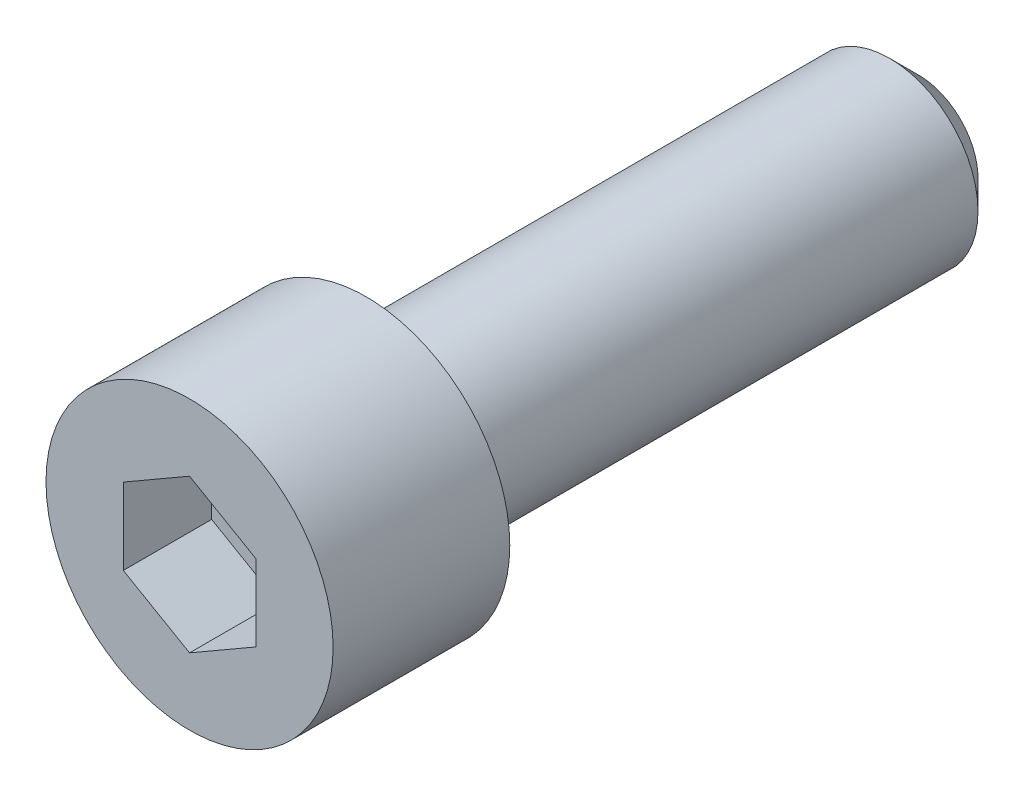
ISO-10303-21;
HEADER;
FILE_DESCRIPTION(('STEP AP214'),'2;1');
FILE_NAME('part.step','',(''),(''),'','','');
FILE_SCHEMA(('AUTOMOTIVE_DESIGN { 1 0 10303 214 1 1 1 1 }'));
ENDSEC;
DATA;
#1=APPLICATION_CONTEXT('core data for automotive mechanical design processes');
#2=APPLICATION_PROTOCOL_DEFINITION('international standard','automotive_design',2000,#1);
#3=PRODUCT_CONTEXT('',#1,'mechanical');
#4=PRODUCT('Part','Part','',(#3));
#5=PRODUCT_RELATED_PRODUCT_CATEGORY('part','',(#4));
#6=PRODUCT_DEFINITION_FORMATION('','',#4);
#7=PRODUCT_DEFINITION_CONTEXT('part definition',#1,'design');
#8=PRODUCT_DEFINITION('design','',#6,#7);
#9=PRODUCT_DEFINITION_SHAPE('','',#8);
#10=(LENGTH_UNIT() NAMED_UNIT(*) SI_UNIT(.MILLI.,.METRE.));
#11=(NAMED_UNIT(*) PLANE_ANGLE_UNIT() SI_UNIT($,.RADIAN.));
#12=(NAMED_UNIT(*) SI_UNIT($,.STERADIAN.) SOLID_ANGLE_UNIT());
#13=UNCERTAINTY_MEASURE_WITH_UNIT(LENGTH_MEASURE(1.E-05),#10,'distance_accuracy_value','');
#14=(GEOMETRIC_REPRESENTATION_CONTEXT(3) GLOBAL_UNCERTAINTY_ASSIGNED_CONTEXT((#13)) GLOBAL_UNIT_ASSIGNED_CONTEXT((#10,
#11,#12)) REPRESENTATION_CONTEXT('',''));
#15=CARTESIAN_POINT('',(0.,0.,0.));
#16=DIRECTION('',(0.,0.,1.));
#17=DIRECTION('',(1.,0.,0.));
#18=AXIS2_PLACEMENT_3D('',#15,#16,#17);
#19=CARTESIAN_POINT('',(0.,3.46410161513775,4.));
#20=DIRECTION('',(-0.5,-0.86602540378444,0.));
#21=DIRECTION('',(0.86602540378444,-0.5,0.));
#22=AXIS2_PLACEMENT_3D('',#19,#20,#21);
#23=PLANE('',#22);
#24=DIRECTION('',(0.,0.,1.));
#25=VECTOR('',#24,1.);
#26=CARTESIAN_POINT('',(3.,1.73205080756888,4.));
#27=LINE('',#26,#25);
#28=CARTESIAN_POINT('',(3.,1.73205080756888,4.));
#29=VERTEX_POINT('',#28);
#30=CARTESIAN_POINT('',(3.,1.73205080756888,8.));
#31=VERTEX_POINT('',#30);
#32=EDGE_CURVE('E63',#29,#31,#27,.T.);
#33=ORIENTED_EDGE('',*,*,#32,.T.);
#34=DIRECTION('',(0.86602540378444,-0.5,0.));
#35=VECTOR('',#34,1.);
#36=CARTESIAN_POINT('',(0.,3.46410161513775,8.));
#37=LINE('',#36,#35);
#38=CARTESIAN_POINT('',(0.,3.46410161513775,8.));
#39=VERTEX_POINT('',#38);
#40=EDGE_CURVE('E29',#39,#31,#37,.T.);
#41=ORIENTED_EDGE('',*,*,#40,.F.);
#42=DIRECTION('',(0.,0.,1.));
#43=VECTOR('',#42,1.);
#44=CARTESIAN_POINT('',(0.,3.46410161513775,4.));
#45=LINE('',#44,#43);
#46=CARTESIAN_POINT('',(0.,3.46410161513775,4.));
#47=VERTEX_POINT('',#46);
#48=EDGE_CURVE('E33',#47,#39,#45,.T.);
#49=ORIENTED_EDGE('',*,*,#48,.F.);
#50=DIRECTION('',(0.86602540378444,-0.5,0.));
#51=VECTOR('',#50,1.);
#52=CARTESIAN_POINT('',(0.,3.46410161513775,4.));
#53=LINE('',#52,#51);
#54=EDGE_CURVE('E65',#47,#29,#53,.T.);
#55=ORIENTED_EDGE('',*,*,#54,.T.);
#56=EDGE_LOOP('',(#33,#41,#49,#55));
#57=FACE_BOUND('',#56,.T.);
#58=ADVANCED_FACE('F14',(#57),#23,.T.);
#59=CARTESIAN_POINT('',(3.,-1.73205080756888,4.));
#60=DIRECTION('',(1.,0.,0.));
#61=DIRECTION('',(0.,0.,-1.));
#62=AXIS2_PLACEMENT_3D('',#59,#60,#61);
#63=PLANE('',#62);
#64=DIRECTION('',(0.,0.,1.));
#65=VECTOR('',#64,1.);
#66=CARTESIAN_POINT('',(3.,-1.73205080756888,4.));
#67=LINE('',#66,#65);
#68=CARTESIAN_POINT('',(3.,-1.73205080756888,4.));
#69=VERTEX_POINT('',#68);
#70=CARTESIAN_POINT('',(3.,-1.73205080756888,8.));
#71=VERTEX_POINT('',#70);
#72=EDGE_CURVE('E70',#69,#71,#67,.T.);
#73=ORIENTED_EDGE('',*,*,#72,.T.);
#74=DIRECTION('',(0.,1.,0.));
#75=VECTOR('',#74,1.);
#76=CARTESIAN_POINT('',(3.,-1.73205080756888,8.));
#77=LINE('',#76,#75);
#78=EDGE_CURVE('E73',#71,#31,#77,.T.);
#79=ORIENTED_EDGE('',*,*,#78,.T.);
#80=ORIENTED_EDGE('',*,*,#32,.F.);
#81=DIRECTION('',(0.,1.,0.));
#82=VECTOR('',#81,1.);
#83=CARTESIAN_POINT('',(3.,-1.73205080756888,4.));
#84=LINE('',#83,#82);
#85=EDGE_CURVE('E100',#69,#29,#84,.T.);
#86=ORIENTED_EDGE('',*,*,#85,.F.);
#87=EDGE_LOOP('',(#73,#79,#80,#86));
#88=FACE_BOUND('',#87,.T.);
#89=ADVANCED_FACE('F74',(#88),#63,.F.);
#90=CARTESIAN_POINT('',(0.,-3.46410161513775,4.));
#91=DIRECTION('',(0.5,-0.86602540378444,0.));
#92=DIRECTION('',(0.86602540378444,0.5,0.));
#93=AXIS2_PLACEMENT_3D('',#90,#91,#92);
#94=PLANE('',#93);
#95=DIRECTION('',(0.,0.,1.));
#96=VECTOR('',#95,1.);
#97=CARTESIAN_POINT('',(0.,-3.46410161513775,4.));
#98=LINE('',#97,#96);
#99=CARTESIAN_POINT('',(0.,-3.46410161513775,4.));
#100=VERTEX_POINT('',#99);
#101=CARTESIAN_POINT('',(0.,-3.46410161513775,8.));
#102=VERTEX_POINT('',#101);
#103=EDGE_CURVE('E108',#100,#102,#98,.T.);
#104=ORIENTED_EDGE('',*,*,#103,.T.);
#105=DIRECTION('',(0.86602540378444,0.5,0.));
#106=VECTOR('',#105,1.);
#107=CARTESIAN_POINT('',(0.,-3.46410161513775,8.));
#108=LINE('',#107,#106);
#109=EDGE_CURVE('E78',#102,#71,#108,.T.);
#110=ORIENTED_EDGE('',*,*,#109,.T.);
#111=ORIENTED_EDGE('',*,*,#72,.F.);
#112=DIRECTION('',(0.86602540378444,0.5,0.));
#113=VECTOR('',#112,1.);
#114=CARTESIAN_POINT('',(0.,-3.46410161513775,4.));
#115=LINE('',#114,#113);
#116=EDGE_CURVE('E97',#100,#69,#115,.T.);
#117=ORIENTED_EDGE('',*,*,#116,.F.);
#118=EDGE_LOOP('',(#104,#110,#111,#117));
#119=FACE_BOUND('',#118,.T.);
#120=ADVANCED_FACE('F141',(#119),#94,.F.);
#121=CARTESIAN_POINT('',(0.,-3.46410161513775,4.));
#122=DIRECTION('',(0.5,0.86602540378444,0.));
#123=DIRECTION('',(-0.86602540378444,0.5,0.));
#124=AXIS2_PLACEMENT_3D('',#121,#122,#123);
#125=PLANE('',#124);
#126=DIRECTION('',(0.,0.,1.));
#127=VECTOR('',#126,1.);
#128=CARTESIAN_POINT('',(-3.,-1.73205080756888,4.));
#129=LINE('',#128,#127);
#130=CARTESIAN_POINT('',(-3.,-1.73205080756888,4.));
#131=VERTEX_POINT('',#130);
#132=CARTESIAN_POINT('',(-3.,-1.73205080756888,8.));
#133=VERTEX_POINT('',#132);
#134=EDGE_CURVE('E106',#131,#133,#129,.T.);
#135=ORIENTED_EDGE('',*,*,#134,.T.);
#136=DIRECTION('',(-0.86602540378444,0.5,0.));
#137=VECTOR('',#136,1.);
#138=CARTESIAN_POINT('',(0.,-3.46410161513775,8.));
#139=LINE('',#138,#137);
#140=EDGE_CURVE('E189',#102,#133,#139,.T.);
#141=ORIENTED_EDGE('',*,*,#140,.F.);
#142=ORIENTED_EDGE('',*,*,#103,.F.);
#143=DIRECTION('',(-0.86602540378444,0.5,0.));
#144=VECTOR('',#143,1.);
#145=CARTESIAN_POINT('',(0.,-3.46410161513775,4.));
#146=LINE('',#145,#144);
#147=EDGE_CURVE('E94',#100,#131,#146,.T.);
#148=ORIENTED_EDGE('',*,*,#147,.T.);
#149=EDGE_LOOP('',(#135,#141,#142,#148));
#150=FACE_BOUND('',#149,.T.);
#151=ADVANCED_FACE('F153',(#150),#125,.T.);
#152=CARTESIAN_POINT('',(-3.,1.73205080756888,4.));
#153=DIRECTION('',(-1.,0.,0.));
#154=DIRECTION('',(0.,-1.,0.));
#155=AXIS2_PLACEMENT_3D('',#152,#153,#154);
#156=PLANE('',#155);
#157=DIRECTION('',(0.,0.,1.));
#158=VECTOR('',#157,1.);
#159=CARTESIAN_POINT('',(-3.,1.73205080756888,4.));
#160=LINE('',#159,#158);
#161=CARTESIAN_POINT('',(-3.,1.73205080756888,4.));
#162=VERTEX_POINT('',#161);
#163=CARTESIAN_POINT('',(-3.,1.73205080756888,8.));
#164=VERTEX_POINT('',#163);
#165=EDGE_CURVE('E104',#162,#164,#160,.T.);
#166=ORIENTED_EDGE('',*,*,#165,.T.);
#167=DIRECTION('',(0.,-1.,0.));
#168=VECTOR('',#167,1.);
#169=CARTESIAN_POINT('',(-3.,1.73205080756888,8.));
#170=LINE('',#169,#168);
#171=EDGE_CURVE('E190',#164,#133,#170,.T.);
#172=ORIENTED_EDGE('',*,*,#171,.T.);
#173=ORIENTED_EDGE('',*,*,#134,.F.);
#174=DIRECTION('',(0.,-1.,0.));
#175=VECTOR('',#174,1.);
#176=CARTESIAN_POINT('',(-3.,1.73205080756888,4.));
#177=LINE('',#176,#175);
#178=EDGE_CURVE('E91',#162,#131,#177,.T.);
#179=ORIENTED_EDGE('',*,*,#178,.F.);
#180=EDGE_LOOP('',(#166,#172,#173,#179));
#181=FACE_BOUND('',#180,.T.);
#182=ADVANCED_FACE('F149',(#181),#156,.F.);
#183=CARTESIAN_POINT('',(0.,3.46410161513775,4.));
#184=DIRECTION('',(-0.5,0.86602540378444,0.));
#185=DIRECTION('',(-0.86602540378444,-0.5,0.));
#186=AXIS2_PLACEMENT_3D('',#183,#184,#185);
#187=PLANE('',#186);
#188=DIRECTION('',(-0.86602540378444,-0.5,0.));
#189=VECTOR('',#188,1.);
#190=CARTESIAN_POINT('',(0.,3.46410161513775,4.));
#191=LINE('',#190,#189);
#192=EDGE_CURVE('E88',#47,#162,#191,.T.);
#193=ORIENTED_EDGE('',*,*,#192,.F.);
#194=ORIENTED_EDGE('',*,*,#48,.T.);
#195=DIRECTION('',(-0.86602540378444,-0.5,0.));
#196=VECTOR('',#195,1.);
#197=CARTESIAN_POINT('',(0.,3.46410161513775,8.));
#198=LINE('',#197,#196);
#199=EDGE_CURVE('E84',#39,#164,#198,.T.);
#200=ORIENTED_EDGE('',*,*,#199,.T.);
#201=ORIENTED_EDGE('',*,*,#165,.F.);
#202=EDGE_LOOP('',(#193,#194,#200,#201));
#203=FACE_BOUND('',#202,.T.);
#204=ADVANCED_FACE('F146',(#203),#187,.F.);
#205=CARTESIAN_POINT('',(-3.,5.19615242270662,4.));
#206=DIRECTION('',(0.,0.,-1.));
#207=DIRECTION('',(-1.,0.,0.));
#208=AXIS2_PLACEMENT_3D('',#205,#206,#207);
#209=PLANE('',#208);
#210=ORIENTED_EDGE('',*,*,#54,.F.);
#211=ORIENTED_EDGE('',*,*,#192,.T.);
#212=ORIENTED_EDGE('',*,*,#178,.T.);
#213=ORIENTED_EDGE('',*,*,#147,.F.);
#214=ORIENTED_EDGE('',*,*,#116,.T.);
#215=ORIENTED_EDGE('',*,*,#85,.T.);
#216=EDGE_LOOP('',(#210,#211,#212,#213,#214,#215));
#217=FACE_BOUND('',#216,.T.);
#218=ADVANCED_FACE('F145',(#217),#209,.F.);
#219=CARTESIAN_POINT('',(0.,0.,8.));
#220=DIRECTION('',(0.,0.,1.));
#221=DIRECTION('',(1.,0.,0.));
#222=AXIS2_PLACEMENT_3D('',#219,#220,#221);
#223=PLANE('',#222);
#224=CARTESIAN_POINT('',(0.,0.,8.));
#225=DIRECTION('',(0.,0.,1.));
#226=DIRECTION('',(1.,0.,0.));
#227=AXIS2_PLACEMENT_3D('',#224,#225,#226);
#228=CIRCLE('',#227,6.5);
#229=CARTESIAN_POINT('',(6.5,0.,8.));
#230=VERTEX_POINT('',#229);
#231=EDGE_CURVE('E116',#230,#230,#228,.T.);
#232=ORIENTED_EDGE('',*,*,#231,.T.);
#233=EDGE_LOOP('',(#232));
#234=FACE_BOUND('',#233,.T.);
#235=ORIENTED_EDGE('',*,*,#199,.F.);
#236=ORIENTED_EDGE('',*,*,#40,.T.);
#237=ORIENTED_EDGE('',*,*,#78,.F.);
#238=ORIENTED_EDGE('',*,*,#109,.F.);
#239=ORIENTED_EDGE('',*,*,#140,.T.);
#240=ORIENTED_EDGE('',*,*,#171,.F.);
#241=EDGE_LOOP('',(#235,#236,#237,#238,#239,#240));
#242=FACE_BOUND('',#241,.T.);
#243=ADVANCED_FACE('F81',(#234,#242),#223,.T.);
#244=CARTESIAN_POINT('',(0.,0.,-5.));
#245=DIRECTION('',(0.,0.,1.));
#246=DIRECTION('',(1.,0.,0.));
#247=AXIS2_PLACEMENT_3D('',#244,#245,#246);
#248=CYLINDRICAL_SURFACE('',#247,6.5);
#249=CARTESIAN_POINT('',(0.,0.,0.));
#250=DIRECTION('',(0.,0.,1.));
#251=DIRECTION('',(1.,0.,0.));
#252=AXIS2_PLACEMENT_3D('',#249,#250,#251);
#253=CIRCLE('',#252,6.5);
#254=CARTESIAN_POINT('',(6.5,0.,0.));
#255=VERTEX_POINT('',#254);
#256=EDGE_CURVE('E113',#255,#255,#253,.T.);
#257=ORIENTED_EDGE('',*,*,#256,.T.);
#258=EDGE_LOOP('',(#257));
#259=FACE_BOUND('',#258,.T.);
#260=ORIENTED_EDGE('',*,*,#231,.F.);
#261=EDGE_LOOP('',(#260));
#262=FACE_BOUND('',#261,.T.);
#263=ADVANCED_FACE('F166',(#259,#262),#248,.T.);
#264=CARTESIAN_POINT('',(6.5,0.,0.));
#265=DIRECTION('',(0.,0.,-1.));
#266=DIRECTION('',(-1.,0.,0.));
#267=AXIS2_PLACEMENT_3D('',#264,#265,#266);
#268=PLANE('',#267);
#269=CARTESIAN_POINT('',(0.,0.,0.));
#270=DIRECTION('',(0.,0.,1.));
#271=DIRECTION('',(1.,0.,0.));
#272=AXIS2_PLACEMENT_3D('',#269,#270,#271);
#273=CIRCLE('',#272,4.);
#274=CARTESIAN_POINT('',(4.,0.,0.));
#275=VERTEX_POINT('',#274);
#276=EDGE_CURVE('E69',#275,#275,#273,.T.);
#277=ORIENTED_EDGE('',*,*,#276,.T.);
#278=EDGE_LOOP('',(#277));
#279=FACE_BOUND('',#278,.T.);
#280=ORIENTED_EDGE('',*,*,#256,.F.);
#281=EDGE_LOOP('',(#280));
#282=FACE_BOUND('',#281,.T.);
#283=ADVANCED_FACE('F163',(#279,#282),#268,.T.);
#284=CARTESIAN_POINT('',(0.,0.,-5.));
#285=DIRECTION('',(0.,0.,1.));
#286=DIRECTION('',(1.,0.,0.));
#287=AXIS2_PLACEMENT_3D('',#284,#285,#286);
#288=CYLINDRICAL_SURFACE('',#287,4.);
#289=CARTESIAN_POINT('',(0.,0.,-23.7));
#290=DIRECTION('',(0.,0.,-1.));
#291=DIRECTION('',(-1.,0.,0.));
#292=AXIS2_PLACEMENT_3D('',#289,#290,#291);
#293=CIRCLE('',#292,4.);
#294=CARTESIAN_POINT('',(-4.,0.,-23.7));
#295=VERTEX_POINT('',#294);
#296=EDGE_CURVE('E22',#295,#295,#293,.F.);
#297=ORIENTED_EDGE('',*,*,#296,.T.);
#298=EDGE_LOOP('',(#297));
#299=FACE_BOUND('',#298,.T.);
#300=ORIENTED_EDGE('',*,*,#276,.F.);
#301=EDGE_LOOP('',(#300));
#302=FACE_BOUND('',#301,.T.);
#303=ADVANCED_FACE('F121',(#299,#302),#288,.T.);
#304=CARTESIAN_POINT('',(4.,0.,-25.));
#305=DIRECTION('',(0.,0.,-1.));
#306=DIRECTION('',(-1.,0.,0.));
#307=AXIS2_PLACEMENT_3D('',#304,#305,#306);
#308=PLANE('',#307);
#309=CARTESIAN_POINT('',(0.,0.,-25.));
#310=DIRECTION('',(0.,0.,-1.));
#311=DIRECTION('',(-1.,0.,0.));
#312=AXIS2_PLACEMENT_3D('',#309,#310,#311);
#313=CIRCLE('',#312,2.7);
#314=CARTESIAN_POINT('',(-2.7,0.,-25.));
#315=VERTEX_POINT('',#314);
#316=EDGE_CURVE('E9',#315,#315,#313,.T.);
#317=ORIENTED_EDGE('',*,*,#316,.T.);
#318=EDGE_LOOP('',(#317));
#319=FACE_BOUND('',#318,.T.);
#320=ADVANCED_FACE('F125',(#319),#308,.T.);
#321=CARTESIAN_POINT('',(0.,0.,-23.7));
#322=DIRECTION('',(0.,0.,1.));
#323=DIRECTION('',(1.,0.,0.));
#324=AXIS2_PLACEMENT_3D('',#321,#322,#323);
#325=CONICAL_SURFACE('',#324,4.,0.78539816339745);
#326=ORIENTED_EDGE('',*,*,#316,.F.);
#327=EDGE_LOOP('',(#326));
#328=FACE_BOUND('',#327,.T.);
#329=ORIENTED_EDGE('',*,*,#296,.F.);
#330=EDGE_LOOP('',(#329));
#331=FACE_BOUND('',#330,.T.);
#332=ADVANCED_FACE('F16',(#328,#331),#325,.T.);
#333=CLOSED_SHELL('',(#58,#89,#120,#151,#182,#204,#218,#243,#263,#283,#303,#320,#332));
#334=MANIFOLD_SOLID_BREP('B1',#333);
#335=ADVANCED_BREP_SHAPE_REPRESENTATION('',(#18,#334),#14);
#336=SHAPE_DEFINITION_REPRESENTATION(#9,#335);
ENDSEC;
END-ISO-10303-21;
